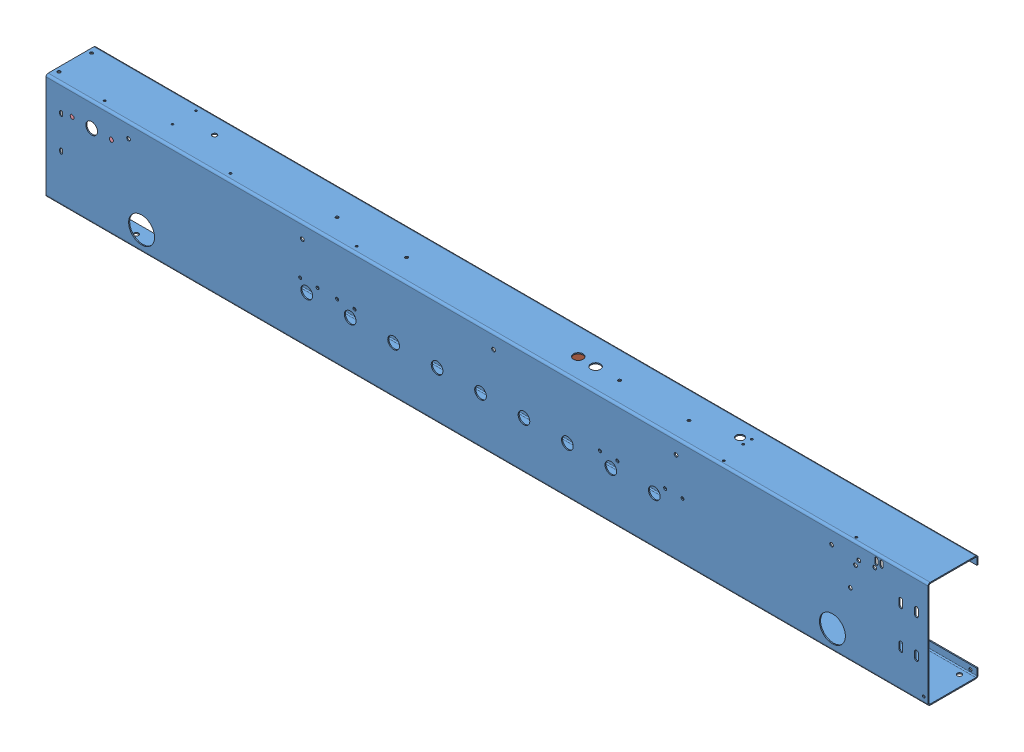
SolidWorks assembly CU010971-S.sldasm, configuration Défaut (file format 3400). Lengths in mm.
Overall size (2030 245 115).
9 component instances, 4 part files, 24 mates.
Components (placement in the parent):
- CU010971-P-S-1: CU010971-P-S.sldprt [Défaut] at (700 0 0) x (-1 0 0) z (0 0 -1) size (2030 245 115)
- CU036085-1: CU036085.sldprt [Défaut] at (-883 2.5 -102.5) x (0 0 1) z (-1 0 0) size (100 240 4)
- CU030931-1: CU030931.sldprt [Défaut] at (-1885 242.5 -110) x (0 0 -1) z (1 0 0) size (32.5 22.5 50)
- CU030931-2: CU030931.sldprt [Défaut] at (-1510 242.5 -110) x (0 0 -1) z (1 0 0) size (32.5 22.5 50)
- CU030931-3: CU030931.sldprt [Défaut] at (-1025 242.5 -110) x (0 0 -1) z (1 0 0) size (32.5 22.5 50)
- CU030931-4: CU030931.sldprt [Défaut] at (-685 242.5 -110) x (0 0 -1) z (1 0 0) size (32.5 22.5 50)
- CU030931-5: CU030931.sldprt [Défaut] at (-295 242.5 -110) x (0 0 -1) z (1 0 0) size (32.5 22.5 50)
- 6004 (25)-1: 6004 (25).sldprt [30] at (-1970 190 0) x (-1 0 0) z (0 0 -1) size (10 10 25)
- 6004 (25)-2: 6004 (25).sldprt [30] at (-1880 190 0) x (-1 0 0) z (0 0 -1) size (10 10 25)
Mates (geometry in assembly coordinates):
- Coïncidente1: coincident anti-aligned: plane of CU010971-P-S-1 through (-2030 242.5 0) normal (0 -1 0); plane of CU030931-1 through (-1860 242.5 -77.5) normal (0 1 0)
- Distance1: distance = 2.5 mm anti-aligned: plane of CU010971-P-S-1 through (-2030 245 -112.5) normal (0 0 1); plane of CU030931-1 through (-1860 242.5 -110) normal (0 0 -1)
- Coïncidente2: coincident anti-aligned: plane of CU010971-P-S-1 through (-2030 242.5 0) normal (0 -1 0); plane of CU030931-2 through (-1485 242.5 -77.5) normal (0 1 0)
- Distance2: distance = 2.5 mm anti-aligned: plane of CU010971-P-S-1 through (-2030 245 -112.5) normal (0 0 1); plane of CU030931-2 through (-1485 242.5 -110) normal (0 0 -1)
- Coïncidente3: coincident anti-aligned: plane of CU010971-P-S-1 through (-2030 242.5 0) normal (0 -1 0); plane of CU030931-3 through (-1000 242.5 -77.5) normal (0 1 0)
- Distance3: distance = 2.5 mm anti-aligned: plane of CU010971-P-S-1 through (-2030 245 -112.5) normal (0 0 1); plane of CU030931-3 through (-1000 242.5 -110) normal (0 0 -1)
- Coïncidente4: coincident anti-aligned: plane of CU010971-P-S-1 through (-2030 242.5 0) normal (0 -1 0); plane of CU030931-5 through (-270 242.5 -77.5) normal (0 1 0)
- Distance4: distance = 2.5 mm anti-aligned: plane of CU010971-P-S-1 through (-2030 245 -112.5) normal (0 0 1); plane of CU030931-5 through (-270 242.5 -110) normal (0 0 -1)
- Coïncidente5: coincident anti-aligned: plane of CU010971-P-S-1 through (-2030 242.5 0) normal (0 -1 0); plane of CU030931-4 through (-660 242.5 -77.5) normal (0 1 0)
- Distance5: distance = 2.5 mm anti-aligned: plane of CU010971-P-S-1 through (-2030 245 -112.5) normal (0 0 1); plane of CU030931-4 through (-660 242.5 -110) normal (0 0 -1)
- Coïncidente6: coincident anti-aligned: plane of CU010971-P-S-1 through (-2030 2.5 0) normal (0 1 0); plane of CU036085-1 through (-887 2.5 -102.5) normal (0 -1 0)
- Coïncidente7: coincident anti-aligned: plane of CU010971-P-S-1 through (-2030 0 -2.5) normal (0 0 -1); plane of CU036085-1 through (-887 12.5 -2.5) normal (0 0 1)
- Coaxiale1: concentric anti-aligned: cylinder of CU010971-P-S-1
- Coïncidente8: coincident aligned: unknown of CU010971-P-S-1
- Coaxiale2: concentric anti-aligned: unknown of CU010971-P-S-1
- Coïncidente9: coincident aligned: unknown of CU010971-P-S-1
- Distance6: distance = 270 mm aligned: plane of CU010971-P-S-1 through (0 240 -112.5) normal (1 0 0); plane of CU030931-5 through (-270 239.5 -107) normal (1 0 0)
- Distance7: distance = 660 mm aligned: plane of CU010971-P-S-1 through (0 240 -112.5) normal (1 0 0); plane of CU030931-4 through (-660 239.5 -107) normal (1 0 0)
- Distance8: distance = 1000 mm aligned: plane of CU010971-P-S-1 through (0 242.5 -5) normal (1 0 0); plane of CU030931-3 through (-1000 239.5 -107) normal (1 0 0)
- Distance9: distance = 1485 mm aligned: plane of CU010971-P-S-1 through (0 5 -110) normal (1 0 0); plane of CU030931-2 through (-1485 241 -107) normal (1 0 0)
- Distance10: distance = 1860 mm aligned: plane of CU010971-P-S-1 through (0 5 -110) normal (1 0 0); plane of CU030931-1 through (-1860 239.5 -107) normal (1 0 0)
- Parallèle1: parallel aligned: unknown of CU010971-P-S-1
- Coïncidente19: coincident aligned: plane of ?; plane of ?
- Distance15: distance = 887 mm anti-aligned: plane of CU010971-P-S-1 through (0 240 -112.5) normal (1 0 0); plane of CU036085-1 through (-887 92.5 -97.5) normal (-1 0 0)
